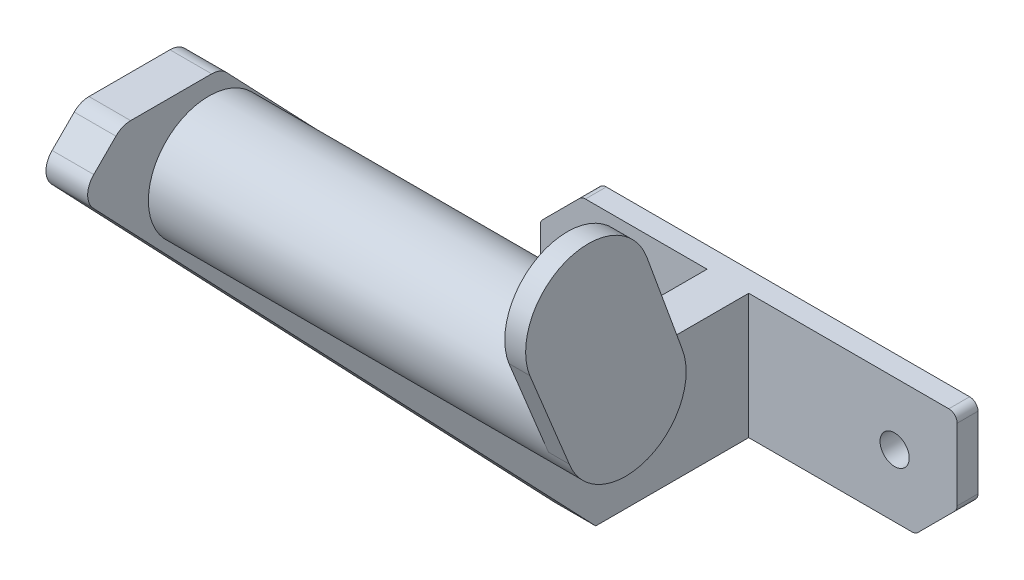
ISO-10303-21;
HEADER;
FILE_DESCRIPTION(('STEP AP214'),'2;1');
FILE_NAME('part.step','',(''),(''),'','','');
FILE_SCHEMA(('AUTOMOTIVE_DESIGN { 1 0 10303 214 1 1 1 1 }'));
ENDSEC;
DATA;
#1=APPLICATION_CONTEXT('core data for automotive mechanical design processes');
#2=APPLICATION_PROTOCOL_DEFINITION('international standard','automotive_design',2000,#1);
#3=PRODUCT_CONTEXT('',#1,'mechanical');
#4=PRODUCT('Part','Part','',(#3));
#5=PRODUCT_RELATED_PRODUCT_CATEGORY('part','',(#4));
#6=PRODUCT_DEFINITION_FORMATION('','',#4);
#7=PRODUCT_DEFINITION_CONTEXT('part definition',#1,'design');
#8=PRODUCT_DEFINITION('design','',#6,#7);
#9=PRODUCT_DEFINITION_SHAPE('','',#8);
#10=(LENGTH_UNIT() NAMED_UNIT(*) SI_UNIT(.MILLI.,.METRE.));
#11=(NAMED_UNIT(*) PLANE_ANGLE_UNIT() SI_UNIT($,.RADIAN.));
#12=(NAMED_UNIT(*) SI_UNIT($,.STERADIAN.) SOLID_ANGLE_UNIT());
#13=UNCERTAINTY_MEASURE_WITH_UNIT(LENGTH_MEASURE(1.E-05),#10,'distance_accuracy_value','');
#14=(GEOMETRIC_REPRESENTATION_CONTEXT(3) GLOBAL_UNCERTAINTY_ASSIGNED_CONTEXT((#13)) GLOBAL_UNIT_ASSIGNED_CONTEXT((#10,
#11,#12)) REPRESENTATION_CONTEXT('',''));
#15=CARTESIAN_POINT('',(0.,0.,0.));
#16=DIRECTION('',(0.,0.,1.));
#17=DIRECTION('',(1.,0.,0.));
#18=AXIS2_PLACEMENT_3D('',#15,#16,#17);
#19=CARTESIAN_POINT('',(145.,144.54626642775,143.51431580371));
#20=DIRECTION('',(1.,0.,0.));
#21=DIRECTION('',(0.,0.,-1.));
#22=AXIS2_PLACEMENT_3D('',#19,#20,#21);
#23=CYLINDRICAL_SURFACE('',#22,15.);
#24=CARTESIAN_POINT('',(145.,144.54626642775,143.51431580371));
#25=DIRECTION('',(1.,0.,0.));
#26=DIRECTION('',(0.,0.,-1.));
#27=AXIS2_PLACEMENT_3D('',#24,#25,#26);
#28=CIRCLE('',#27,15.);
#29=CARTESIAN_POINT('',(145.,149.948852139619,129.521029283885));
#30=VERTEX_POINT('',#29);
#31=CARTESIAN_POINT('',(145.,139.143680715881,157.507602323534));
#32=VERTEX_POINT('',#31);
#33=EDGE_CURVE('E292',#30,#32,#28,.T.);
#34=ORIENTED_EDGE('',*,*,#33,.T.);
#35=DIRECTION('',(1.,0.,0.));
#36=VECTOR('',#35,1.);
#37=CARTESIAN_POINT('',(145.,139.143680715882,157.507602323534));
#38=LINE('',#37,#36);
#39=CARTESIAN_POINT('',(150.,139.143680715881,157.507602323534));
#40=VERTEX_POINT('',#39);
#41=EDGE_CURVE('E301',#40,#32,#38,.F.);
#42=ORIENTED_EDGE('',*,*,#41,.F.);
#43=CARTESIAN_POINT('',(150.,144.54626642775,143.51431580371));
#44=DIRECTION('',(1.,0.,0.));
#45=DIRECTION('',(0.,0.,-1.));
#46=AXIS2_PLACEMENT_3D('',#43,#44,#45);
#47=CIRCLE('',#46,15.);
#48=CARTESIAN_POINT('',(150.,149.948852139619,129.521029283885));
#49=VERTEX_POINT('',#48);
#50=EDGE_CURVE('E302',#49,#40,#47,.T.);
#51=ORIENTED_EDGE('',*,*,#50,.F.);
#52=DIRECTION('',(1.,0.,0.));
#53=VECTOR('',#52,1.);
#54=CARTESIAN_POINT('',(145.,149.948852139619,129.521029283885));
#55=LINE('',#54,#53);
#56=EDGE_CURVE('E306',#30,#49,#55,.T.);
#57=ORIENTED_EDGE('',*,*,#56,.F.);
#58=EDGE_LOOP('',(#34,#42,#51,#57));
#59=FACE_BOUND('',#58,.T.);
#60=ADVANCED_FACE('F17',(#59),#23,.T.);
#61=CARTESIAN_POINT('',(98.,10.8284271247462,5.));
#62=DIRECTION('',(0.,0.,-1.));
#63=DIRECTION('',(-1.,0.,0.));
#64=AXIS2_PLACEMENT_3D('',#61,#62,#63);
#65=CYLINDRICAL_SURFACE('',#64,2.);
#66=CARTESIAN_POINT('',(98.,10.8284271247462,0.));
#67=DIRECTION('',(0.,0.,-1.));
#68=DIRECTION('',(-1.,0.,0.));
#69=AXIS2_PLACEMENT_3D('',#66,#67,#68);
#70=CIRCLE('',#69,2.);
#71=CARTESIAN_POINT('',(99.4142135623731,9.4142135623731,0.));
#72=VERTEX_POINT('',#71);
#73=CARTESIAN_POINT('',(100.,10.8284271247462,0.));
#74=VERTEX_POINT('',#73);
#75=EDGE_CURVE('E182',#72,#74,#70,.F.);
#76=ORIENTED_EDGE('',*,*,#75,.T.);
#77=DIRECTION('',(0.,0.,1.));
#78=VECTOR('',#77,1.);
#79=CARTESIAN_POINT('',(100.,10.8284271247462,5.));
#80=LINE('',#79,#78);
#81=CARTESIAN_POINT('',(100.,10.8284271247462,5.));
#82=VERTEX_POINT('',#81);
#83=EDGE_CURVE('E180',#74,#82,#80,.T.);
#84=ORIENTED_EDGE('',*,*,#83,.T.);
#85=CARTESIAN_POINT('',(98.,10.8284271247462,5.));
#86=DIRECTION('',(0.,0.,-1.));
#87=DIRECTION('',(-1.,0.,0.));
#88=AXIS2_PLACEMENT_3D('',#85,#86,#87);
#89=CIRCLE('',#88,2.);
#90=CARTESIAN_POINT('',(99.4142135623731,9.4142135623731,5.));
#91=VERTEX_POINT('',#90);
#92=EDGE_CURVE('E20',#82,#91,#89,.T.);
#93=ORIENTED_EDGE('',*,*,#92,.T.);
#94=DIRECTION('',(0.,0.,1.));
#95=VECTOR('',#94,1.);
#96=CARTESIAN_POINT('',(99.4142135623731,9.4142135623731,5.));
#97=LINE('',#96,#95);
#98=EDGE_CURVE('E177',#91,#72,#97,.F.);
#99=ORIENTED_EDGE('',*,*,#98,.T.);
#100=EDGE_LOOP('',(#76,#84,#93,#99));
#101=FACE_BOUND('',#100,.T.);
#102=ADVANCED_FACE('F176',(#101),#65,.T.);
#103=CARTESIAN_POINT('',(145.,149.948852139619,129.521029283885));
#104=DIRECTION('',(0.,0.34144638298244,-0.939901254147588));
#105=DIRECTION('',(0.,0.939901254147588,0.34144638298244));
#106=AXIS2_PLACEMENT_3D('',#103,#104,#105);
#107=PLANE('',#106);
#108=DIRECTION('',(0.,0.939901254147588,0.34144638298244));
#109=VECTOR('',#108,1.);
#110=CARTESIAN_POINT('',(145.,126.446621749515,120.983162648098));
#111=LINE('',#110,#109);
#112=CARTESIAN_POINT('',(145.,126.446621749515,120.983162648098));
#113=VERTEX_POINT('',#112);
#114=EDGE_CURVE('E286',#113,#30,#111,.T.);
#115=ORIENTED_EDGE('',*,*,#114,.T.);
#116=ORIENTED_EDGE('',*,*,#56,.T.);
#117=DIRECTION('',(0.,0.939901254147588,0.34144638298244));
#118=VECTOR('',#117,1.);
#119=CARTESIAN_POINT('',(150.,126.446621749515,120.983162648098));
#120=LINE('',#119,#118);
#121=CARTESIAN_POINT('',(150.,126.446621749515,120.983162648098));
#122=VERTEX_POINT('',#121);
#123=EDGE_CURVE('E303',#122,#49,#120,.T.);
#124=ORIENTED_EDGE('',*,*,#123,.F.);
#125=DIRECTION('',(-1.,0.,0.));
#126=VECTOR('',#125,1.);
#127=CARTESIAN_POINT('',(150.,126.446621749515,120.983162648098));
#128=LINE('',#127,#126);
#129=EDGE_CURVE('E189',#113,#122,#128,.F.);
#130=ORIENTED_EDGE('',*,*,#129,.F.);
#131=EDGE_LOOP('',(#115,#116,#124,#130));
#132=FACE_BOUND('',#131,.T.);
#133=ADVANCED_FACE('F762',(#132),#107,.T.);
#134=CARTESIAN_POINT('',(150.,121.224122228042,134.510006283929));
#135=DIRECTION('',(1.,0.,0.));
#136=DIRECTION('',(0.,0.,-1.));
#137=AXIS2_PLACEMENT_3D('',#134,#135,#136);
#138=PLANE('',#137);
#139=ORIENTED_EDGE('',*,*,#50,.T.);
#140=DIRECTION('',(0.,-0.925497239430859,-0.378754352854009));
#141=VECTOR('',#140,1.);
#142=CARTESIAN_POINT('',(150.,116.001622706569,148.036849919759));
#143=LINE('',#142,#141);
#144=CARTESIAN_POINT('',(150.,116.001622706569,148.036849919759));
#145=VERTEX_POINT('',#144);
#146=EDGE_CURVE('E298',#145,#40,#143,.F.);
#147=ORIENTED_EDGE('',*,*,#146,.F.);
#148=CARTESIAN_POINT('',(150.,121.224122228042,134.510006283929));
#149=DIRECTION('',(-1.,0.,0.));
#150=DIRECTION('',(0.,0.,1.));
#151=AXIS2_PLACEMENT_3D('',#148,#149,#150);
#152=CIRCLE('',#151,14.5);
#153=EDGE_CURVE('E297',#122,#145,#152,.T.);
#154=ORIENTED_EDGE('',*,*,#153,.F.);
#155=ORIENTED_EDGE('',*,*,#123,.T.);
#156=EDGE_LOOP('',(#139,#147,#154,#155));
#157=FACE_BOUND('',#156,.T.);
#158=ADVANCED_FACE('F753',(#157),#138,.T.);
#159=CARTESIAN_POINT('',(145.,116.001622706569,148.036849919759));
#160=DIRECTION('',(0.,-0.378754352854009,0.925497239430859));
#161=DIRECTION('',(0.,-0.925497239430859,-0.378754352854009));
#162=AXIS2_PLACEMENT_3D('',#159,#160,#161);
#163=PLANE('',#162);
#164=DIRECTION('',(0.,-0.925497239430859,-0.378754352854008));
#165=VECTOR('',#164,1.);
#166=CARTESIAN_POINT('',(145.,139.143680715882,157.507602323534));
#167=LINE('',#166,#165);
#168=CARTESIAN_POINT('',(145.,116.001622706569,148.036849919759));
#169=VERTEX_POINT('',#168);
#170=EDGE_CURVE('E290',#32,#169,#167,.T.);
#171=ORIENTED_EDGE('',*,*,#170,.T.);
#172=DIRECTION('',(-1.,0.,0.));
#173=VECTOR('',#172,1.);
#174=CARTESIAN_POINT('',(150.,116.001622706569,148.036849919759));
#175=LINE('',#174,#173);
#176=EDGE_CURVE('E293',#145,#169,#175,.T.);
#177=ORIENTED_EDGE('',*,*,#176,.F.);
#178=ORIENTED_EDGE('',*,*,#146,.T.);
#179=ORIENTED_EDGE('',*,*,#41,.T.);
#180=EDGE_LOOP('',(#171,#177,#178,#179));
#181=FACE_BOUND('',#180,.T.);
#182=ADVANCED_FACE('F744',(#181),#163,.T.);
#183=CARTESIAN_POINT('',(145.,144.54626642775,143.51431580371));
#184=DIRECTION('',(1.,0.,0.));
#185=DIRECTION('',(0.,0.,-1.));
#186=AXIS2_PLACEMENT_3D('',#183,#184,#185);
#187=PLANE('',#186);
#188=ORIENTED_EDGE('',*,*,#114,.F.);
#189=CARTESIAN_POINT('',(145.,121.224122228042,134.510006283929));
#190=DIRECTION('',(-1.,0.,0.));
#191=DIRECTION('',(0.,0.,1.));
#192=AXIS2_PLACEMENT_3D('',#189,#190,#191);
#193=CIRCLE('',#192,14.5);
#194=EDGE_CURVE('E296',#169,#113,#193,.T.);
#195=ORIENTED_EDGE('',*,*,#194,.F.);
#196=ORIENTED_EDGE('',*,*,#170,.F.);
#197=ORIENTED_EDGE('',*,*,#33,.F.);
#198=EDGE_LOOP('',(#188,#195,#196,#197));
#199=FACE_BOUND('',#198,.T.);
#200=ADVANCED_FACE('F736',(#199),#187,.F.);
#201=CARTESIAN_POINT('',(2.,19.1715728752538,5.));
#202=DIRECTION('',(0.,0.,-1.));
#203=DIRECTION('',(-1.,0.,0.));
#204=AXIS2_PLACEMENT_3D('',#201,#202,#203);
#205=CYLINDRICAL_SURFACE('',#204,2.);
#206=CARTESIAN_POINT('',(2.,19.1715728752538,0.));
#207=DIRECTION('',(0.,0.,-1.));
#208=DIRECTION('',(-1.,0.,0.));
#209=AXIS2_PLACEMENT_3D('',#206,#207,#208);
#210=CIRCLE('',#209,2.);
#211=CARTESIAN_POINT('',(0.585786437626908,20.5857864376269,0.));
#212=VERTEX_POINT('',#211);
#213=CARTESIAN_POINT('',(0.,19.1715728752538,0.));
#214=VERTEX_POINT('',#213);
#215=EDGE_CURVE('E283',#212,#214,#210,.F.);
#216=ORIENTED_EDGE('',*,*,#215,.T.);
#217=DIRECTION('',(0.,0.,-1.));
#218=VECTOR('',#217,1.);
#219=CARTESIAN_POINT('',(0.,19.1715728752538,5.));
#220=LINE('',#219,#218);
#221=CARTESIAN_POINT('',(0.,19.1715728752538,5.));
#222=VERTEX_POINT('',#221);
#223=EDGE_CURVE('E249',#214,#222,#220,.F.);
#224=ORIENTED_EDGE('',*,*,#223,.T.);
#225=CARTESIAN_POINT('',(2.,19.1715728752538,5.));
#226=DIRECTION('',(0.,0.,-1.));
#227=DIRECTION('',(-1.,0.,0.));
#228=AXIS2_PLACEMENT_3D('',#225,#226,#227);
#229=CIRCLE('',#228,2.);
#230=CARTESIAN_POINT('',(0.585786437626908,20.5857864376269,5.));
#231=VERTEX_POINT('',#230);
#232=EDGE_CURVE('E289',#222,#231,#229,.T.);
#233=ORIENTED_EDGE('',*,*,#232,.T.);
#234=DIRECTION('',(0.,0.,1.));
#235=VECTOR('',#234,1.);
#236=CARTESIAN_POINT('',(0.585786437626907,20.5857864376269,5.));
#237=LINE('',#236,#235);
#238=EDGE_CURVE('E245',#231,#212,#237,.F.);
#239=ORIENTED_EDGE('',*,*,#238,.T.);
#240=EDGE_LOOP('',(#216,#224,#233,#239));
#241=FACE_BOUND('',#240,.T.);
#242=ADVANCED_FACE('F499',(#241),#205,.T.);
#243=CARTESIAN_POINT('',(85.,15.,0.));
#244=DIRECTION('',(0.,0.,1.));
#245=DIRECTION('',(1.,0.,0.));
#246=AXIS2_PLACEMENT_3D('',#243,#244,#245);
#247=CYLINDRICAL_SURFACE('',#246,3.5);
#248=CARTESIAN_POINT('',(85.,15.,0.));
#249=DIRECTION('',(0.,0.,1.));
#250=DIRECTION('',(1.,0.,0.));
#251=AXIS2_PLACEMENT_3D('',#248,#249,#250);
#252=CIRCLE('',#251,3.5);
#253=CARTESIAN_POINT('',(88.5,15.,0.));
#254=VERTEX_POINT('',#253);
#255=EDGE_CURVE('E240',#254,#254,#252,.T.);
#256=ORIENTED_EDGE('',*,*,#255,.F.);
#257=EDGE_LOOP('',(#256));
#258=FACE_BOUND('',#257,.T.);
#259=CARTESIAN_POINT('',(85.,15.,5.));
#260=DIRECTION('',(0.,0.,1.));
#261=DIRECTION('',(1.,0.,0.));
#262=AXIS2_PLACEMENT_3D('',#259,#260,#261);
#263=CIRCLE('',#262,3.5);
#264=CARTESIAN_POINT('',(88.5,15.,5.));
#265=VERTEX_POINT('',#264);
#266=EDGE_CURVE('E342',#265,#265,#263,.T.);
#267=ORIENTED_EDGE('',*,*,#266,.T.);
#268=EDGE_LOOP('',(#267));
#269=FACE_BOUND('',#268,.T.);
#270=ADVANCED_FACE('F720',(#258,#269),#247,.F.);
#271=CARTESIAN_POINT('',(100.,0.,5.));
#272=DIRECTION('',(-1.,0.,0.));
#273=DIRECTION('',(0.,0.,1.));
#274=AXIS2_PLACEMENT_3D('',#271,#272,#273);
#275=PLANE('',#274);
#276=ORIENTED_EDGE('',*,*,#83,.F.);
#277=DIRECTION('',(0.,1.,0.));
#278=VECTOR('',#277,1.);
#279=CARTESIAN_POINT('',(100.,0.,0.));
#280=LINE('',#279,#278);
#281=CARTESIAN_POINT('',(100.,28.,0.));
#282=VERTEX_POINT('',#281);
#283=EDGE_CURVE('E226',#282,#74,#280,.F.);
#284=ORIENTED_EDGE('',*,*,#283,.F.);
#285=DIRECTION('',(0.,0.,-1.));
#286=VECTOR('',#285,1.);
#287=CARTESIAN_POINT('',(100.,28.,5.));
#288=LINE('',#287,#286);
#289=CARTESIAN_POINT('',(100.,28.,5.));
#290=VERTEX_POINT('',#289);
#291=EDGE_CURVE('E255',#290,#282,#288,.T.);
#292=ORIENTED_EDGE('',*,*,#291,.F.);
#293=DIRECTION('',(0.,1.,0.));
#294=VECTOR('',#293,1.);
#295=CARTESIAN_POINT('',(100.,0.,5.));
#296=LINE('',#295,#294);
#297=EDGE_CURVE('E196',#290,#82,#296,.F.);
#298=ORIENTED_EDGE('',*,*,#297,.T.);
#299=EDGE_LOOP('',(#276,#284,#292,#298));
#300=FACE_BOUND('',#299,.T.);
#301=ADVANCED_FACE('F367',(#300),#275,.F.);
#302=CARTESIAN_POINT('',(100.,10.,5.));
#303=DIRECTION('',(-0.707106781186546,0.707106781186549,0.));
#304=DIRECTION('',(-0.707106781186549,-0.707106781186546,0.));
#305=AXIS2_PLACEMENT_3D('',#302,#303,#304);
#306=PLANE('',#305);
#307=DIRECTION('',(0.,0.,1.));
#308=VECTOR('',#307,1.);
#309=CARTESIAN_POINT('',(90.5857864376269,0.585786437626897,5.));
#310=LINE('',#309,#308);
#311=CARTESIAN_POINT('',(90.5857864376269,0.5857864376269,0.));
#312=VERTEX_POINT('',#311);
#313=CARTESIAN_POINT('',(90.5857864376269,0.585786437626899,5.));
#314=VERTEX_POINT('',#313);
#315=EDGE_CURVE('E252',#312,#314,#310,.T.);
#316=ORIENTED_EDGE('',*,*,#315,.F.);
#317=DIRECTION('',(-0.707106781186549,-0.707106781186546,0.));
#318=VECTOR('',#317,1.);
#319=CARTESIAN_POINT('',(99.4142135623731,9.41421356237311,0.));
#320=LINE('',#319,#318);
#321=EDGE_CURVE('E188',#72,#312,#320,.T.);
#322=ORIENTED_EDGE('',*,*,#321,.F.);
#323=ORIENTED_EDGE('',*,*,#98,.F.);
#324=DIRECTION('',(-0.707106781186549,-0.707106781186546,0.));
#325=VECTOR('',#324,1.);
#326=CARTESIAN_POINT('',(99.4142135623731,9.4142135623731,5.));
#327=LINE('',#326,#325);
#328=EDGE_CURVE('E185',#91,#314,#327,.T.);
#329=ORIENTED_EDGE('',*,*,#328,.T.);
#330=EDGE_LOOP('',(#316,#322,#323,#329));
#331=FACE_BOUND('',#330,.T.);
#332=ADVANCED_FACE('F184',(#331),#306,.F.);
#333=CARTESIAN_POINT('',(150.,121.224122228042,134.510006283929));
#334=DIRECTION('',(-1.,0.,0.));
#335=DIRECTION('',(0.,0.,1.));
#336=AXIS2_PLACEMENT_3D('',#333,#334,#335);
#337=CYLINDRICAL_SURFACE('',#336,14.5);
#338=ORIENTED_EDGE('',*,*,#129,.T.);
#339=ORIENTED_EDGE('',*,*,#153,.T.);
#340=ORIENTED_EDGE('',*,*,#176,.T.);
#341=ORIENTED_EDGE('',*,*,#194,.T.);
#342=EDGE_LOOP('',(#338,#339,#340,#341));
#343=FACE_BOUND('',#342,.T.);
#344=CARTESIAN_POINT('',(50.,121.224122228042,134.510006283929));
#345=DIRECTION('',(-1.,0.,0.));
#346=DIRECTION('',(0.,0.,1.));
#347=AXIS2_PLACEMENT_3D('',#344,#345,#346);
#348=CIRCLE('',#347,14.5);
#349=CARTESIAN_POINT('',(50.,121.224122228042,149.010006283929));
#350=VERTEX_POINT('',#349);
#351=EDGE_CURVE('E198',#350,#350,#348,.F.);
#352=ORIENTED_EDGE('',*,*,#351,.T.);
#353=EDGE_LOOP('',(#352));
#354=FACE_BOUND('',#353,.T.);
#355=ADVANCED_FACE('F506',(#343,#354),#337,.T.);
#356=CARTESIAN_POINT('',(10.8284271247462,28.,5.));
#357=DIRECTION('',(0.,0.,1.));
#358=DIRECTION('',(1.,0.,0.));
#359=AXIS2_PLACEMENT_3D('',#356,#357,#358);
#360=CYLINDRICAL_SURFACE('',#359,2.);
#361=CARTESIAN_POINT('',(10.8284271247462,28.,5.));
#362=DIRECTION('',(0.,0.,1.));
#363=DIRECTION('',(1.,0.,0.));
#364=AXIS2_PLACEMENT_3D('',#361,#362,#363);
#365=CIRCLE('',#364,2.);
#366=CARTESIAN_POINT('',(9.41421356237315,29.4142135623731,5.));
#367=VERTEX_POINT('',#366);
#368=CARTESIAN_POINT('',(10.8284271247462,30.,5.));
#369=VERTEX_POINT('',#368);
#370=EDGE_CURVE('E285',#367,#369,#365,.F.);
#371=ORIENTED_EDGE('',*,*,#370,.T.);
#372=DIRECTION('',(0.,0.,-1.));
#373=VECTOR('',#372,1.);
#374=CARTESIAN_POINT('',(10.8284271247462,30.,5.));
#375=LINE('',#374,#373);
#376=CARTESIAN_POINT('',(10.8284271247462,30.,0.));
#377=VERTEX_POINT('',#376);
#378=EDGE_CURVE('E241',#369,#377,#375,.T.);
#379=ORIENTED_EDGE('',*,*,#378,.T.);
#380=CARTESIAN_POINT('',(10.8284271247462,28.,0.));
#381=DIRECTION('',(0.,0.,1.));
#382=DIRECTION('',(1.,0.,0.));
#383=AXIS2_PLACEMENT_3D('',#380,#381,#382);
#384=CIRCLE('',#383,2.);
#385=CARTESIAN_POINT('',(9.41421356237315,29.4142135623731,0.));
#386=VERTEX_POINT('',#385);
#387=EDGE_CURVE('E234',#386,#377,#384,.F.);
#388=ORIENTED_EDGE('',*,*,#387,.F.);
#389=DIRECTION('',(0.,0.,1.));
#390=VECTOR('',#389,1.);
#391=CARTESIAN_POINT('',(9.41421356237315,29.4142135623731,5.));
#392=LINE('',#391,#390);
#393=EDGE_CURVE('E248',#386,#367,#392,.T.);
#394=ORIENTED_EDGE('',*,*,#393,.T.);
#395=EDGE_LOOP('',(#371,#379,#388,#394));
#396=FACE_BOUND('',#395,.T.);
#397=ADVANCED_FACE('F504',(#396),#360,.T.);
#398=CARTESIAN_POINT('',(98.,28.,5.));
#399=DIRECTION('',(0.,0.,-1.));
#400=DIRECTION('',(-1.,0.,0.));
#401=AXIS2_PLACEMENT_3D('',#398,#399,#400);
#402=CYLINDRICAL_SURFACE('',#401,2.);
#403=CARTESIAN_POINT('',(98.,28.,0.));
#404=DIRECTION('',(0.,0.,-1.));
#405=DIRECTION('',(-1.,0.,0.));
#406=AXIS2_PLACEMENT_3D('',#403,#404,#405);
#407=CIRCLE('',#406,2.);
#408=CARTESIAN_POINT('',(98.,30.,0.));
#409=VERTEX_POINT('',#408);
#410=EDGE_CURVE('E230',#409,#282,#407,.T.);
#411=ORIENTED_EDGE('',*,*,#410,.F.);
#412=DIRECTION('',(0.,0.,-1.));
#413=VECTOR('',#412,1.);
#414=CARTESIAN_POINT('',(98.,30.,5.));
#415=LINE('',#414,#413);
#416=CARTESIAN_POINT('',(98.,30.,5.));
#417=VERTEX_POINT('',#416);
#418=EDGE_CURVE('E259',#409,#417,#415,.F.);
#419=ORIENTED_EDGE('',*,*,#418,.T.);
#420=CARTESIAN_POINT('',(98.,28.,5.));
#421=DIRECTION('',(0.,0.,-1.));
#422=DIRECTION('',(-1.,0.,0.));
#423=AXIS2_PLACEMENT_3D('',#420,#421,#422);
#424=CIRCLE('',#423,2.);
#425=EDGE_CURVE('E200',#417,#290,#424,.T.);
#426=ORIENTED_EDGE('',*,*,#425,.T.);
#427=ORIENTED_EDGE('',*,*,#291,.T.);
#428=EDGE_LOOP('',(#411,#419,#426,#427));
#429=FACE_BOUND('',#428,.T.);
#430=ADVANCED_FACE('F373',(#429),#402,.T.);
#431=CARTESIAN_POINT('',(15.,15.,0.));
#432=DIRECTION('',(0.,0.,1.));
#433=DIRECTION('',(1.,0.,0.));
#434=AXIS2_PLACEMENT_3D('',#431,#432,#433);
#435=CYLINDRICAL_SURFACE('',#434,3.5);
#436=CARTESIAN_POINT('',(15.,15.,0.));
#437=DIRECTION('',(0.,0.,1.));
#438=DIRECTION('',(1.,0.,0.));
#439=AXIS2_PLACEMENT_3D('',#436,#437,#438);
#440=CIRCLE('',#439,3.5);
#441=CARTESIAN_POINT('',(18.5,15.,0.));
#442=VERTEX_POINT('',#441);
#443=EDGE_CURVE('E280',#442,#442,#440,.T.);
#444=ORIENTED_EDGE('',*,*,#443,.F.);
#445=EDGE_LOOP('',(#444));
#446=FACE_BOUND('',#445,.T.);
#447=CARTESIAN_POINT('',(15.,15.,5.));
#448=DIRECTION('',(0.,0.,1.));
#449=DIRECTION('',(1.,0.,0.));
#450=AXIS2_PLACEMENT_3D('',#447,#448,#449);
#451=CIRCLE('',#450,3.5);
#452=CARTESIAN_POINT('',(18.5,15.,5.));
#453=VERTEX_POINT('',#452);
#454=EDGE_CURVE('E269',#453,#453,#451,.T.);
#455=ORIENTED_EDGE('',*,*,#454,.T.);
#456=EDGE_LOOP('',(#455));
#457=FACE_BOUND('',#456,.T.);
#458=ADVANCED_FACE('F513',(#446,#457),#435,.F.);
#459=CARTESIAN_POINT('',(0.,0.,5.));
#460=DIRECTION('',(1.,0.,0.));
#461=DIRECTION('',(0.,0.,-1.));
#462=AXIS2_PLACEMENT_3D('',#459,#460,#461);
#463=PLANE('',#462);
#464=ORIENTED_EDGE('',*,*,#223,.F.);
#465=DIRECTION('',(0.,1.,0.));
#466=VECTOR('',#465,1.);
#467=CARTESIAN_POINT('',(0.,0.,0.));
#468=LINE('',#467,#466);
#469=CARTESIAN_POINT('',(0.,2.,0.));
#470=VERTEX_POINT('',#469);
#471=EDGE_CURVE('E235',#470,#214,#468,.T.);
#472=ORIENTED_EDGE('',*,*,#471,.F.);
#473=DIRECTION('',(0.,0.,-1.));
#474=VECTOR('',#473,1.);
#475=CARTESIAN_POINT('',(0.,2.,5.));
#476=LINE('',#475,#474);
#477=CARTESIAN_POINT('',(0.,2.,5.));
#478=VERTEX_POINT('',#477);
#479=EDGE_CURVE('E229',#478,#470,#476,.T.);
#480=ORIENTED_EDGE('',*,*,#479,.F.);
#481=DIRECTION('',(0.,1.,0.));
#482=VECTOR('',#481,1.);
#483=CARTESIAN_POINT('',(0.,0.,5.));
#484=LINE('',#483,#482);
#485=EDGE_CURVE('E332',#478,#222,#484,.T.);
#486=ORIENTED_EDGE('',*,*,#485,.T.);
#487=EDGE_LOOP('',(#464,#472,#480,#486));
#488=FACE_BOUND('',#487,.T.);
#489=ADVANCED_FACE('F495',(#488),#463,.F.);
#490=CARTESIAN_POINT('',(0.,20.,5.));
#491=DIRECTION('',(0.707106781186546,-0.707106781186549,0.));
#492=DIRECTION('',(0.707106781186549,0.707106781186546,0.));
#493=AXIS2_PLACEMENT_3D('',#490,#491,#492);
#494=PLANE('',#493);
#495=ORIENTED_EDGE('',*,*,#393,.F.);
#496=DIRECTION('',(0.707106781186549,0.707106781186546,0.));
#497=VECTOR('',#496,1.);
#498=CARTESIAN_POINT('',(0.585786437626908,20.5857864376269,0.));
#499=LINE('',#498,#497);
#500=EDGE_CURVE('E231',#212,#386,#499,.T.);
#501=ORIENTED_EDGE('',*,*,#500,.F.);
#502=ORIENTED_EDGE('',*,*,#238,.F.);
#503=DIRECTION('',(0.707106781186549,0.707106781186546,0.));
#504=VECTOR('',#503,1.);
#505=CARTESIAN_POINT('',(0.585786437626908,20.5857864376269,5.));
#506=LINE('',#505,#504);
#507=EDGE_CURVE('E452',#231,#367,#506,.T.);
#508=ORIENTED_EDGE('',*,*,#507,.T.);
#509=EDGE_LOOP('',(#495,#501,#502,#508));
#510=FACE_BOUND('',#509,.T.);
#511=ADVANCED_FACE('F501',(#510),#494,.F.);
#512=CARTESIAN_POINT('',(89.1715728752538,2.,5.));
#513=DIRECTION('',(0.,0.,1.));
#514=DIRECTION('',(1.,0.,0.));
#515=AXIS2_PLACEMENT_3D('',#512,#513,#514);
#516=CYLINDRICAL_SURFACE('',#515,2.);
#517=CARTESIAN_POINT('',(89.1715728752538,2.,5.));
#518=DIRECTION('',(0.,0.,1.));
#519=DIRECTION('',(1.,0.,0.));
#520=AXIS2_PLACEMENT_3D('',#517,#518,#519);
#521=CIRCLE('',#520,2.);
#522=CARTESIAN_POINT('',(89.1715728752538,0.,5.));
#523=VERTEX_POINT('',#522);
#524=EDGE_CURVE('E195',#314,#523,#521,.F.);
#525=ORIENTED_EDGE('',*,*,#524,.T.);
#526=DIRECTION('',(0.,0.,1.));
#527=VECTOR('',#526,1.);
#528=CARTESIAN_POINT('',(89.1715728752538,0.,5.));
#529=LINE('',#528,#527);
#530=CARTESIAN_POINT('',(89.1715728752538,0.,0.));
#531=VERTEX_POINT('',#530);
#532=EDGE_CURVE('E206',#523,#531,#529,.F.);
#533=ORIENTED_EDGE('',*,*,#532,.T.);
#534=CARTESIAN_POINT('',(89.1715728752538,2.,0.));
#535=DIRECTION('',(0.,0.,1.));
#536=DIRECTION('',(1.,0.,0.));
#537=AXIS2_PLACEMENT_3D('',#534,#535,#536);
#538=CIRCLE('',#537,2.);
#539=EDGE_CURVE('E238',#312,#531,#538,.F.);
#540=ORIENTED_EDGE('',*,*,#539,.F.);
#541=ORIENTED_EDGE('',*,*,#315,.T.);
#542=EDGE_LOOP('',(#525,#533,#540,#541));
#543=FACE_BOUND('',#542,.T.);
#544=ADVANCED_FACE('F481',(#543),#516,.T.);
#545=CARTESIAN_POINT('',(0.,0.,0.));
#546=DIRECTION('',(0.,0.,-1.));
#547=DIRECTION('',(-1.,0.,0.));
#548=AXIS2_PLACEMENT_3D('',#545,#546,#547);
#549=PLANE('',#548);
#550=ORIENTED_EDGE('',*,*,#283,.T.);
#551=ORIENTED_EDGE('',*,*,#75,.F.);
#552=ORIENTED_EDGE('',*,*,#321,.T.);
#553=ORIENTED_EDGE('',*,*,#539,.T.);
#554=DIRECTION('',(1.,0.,0.));
#555=VECTOR('',#554,1.);
#556=CARTESIAN_POINT('',(0.,0.,0.));
#557=LINE('',#556,#555);
#558=CARTESIAN_POINT('',(2.,0.,0.));
#559=VERTEX_POINT('',#558);
#560=EDGE_CURVE('E208',#531,#559,#557,.F.);
#561=ORIENTED_EDGE('',*,*,#560,.T.);
#562=CARTESIAN_POINT('',(2.,2.,0.));
#563=DIRECTION('',(0.,0.,-1.));
#564=DIRECTION('',(-1.,0.,0.));
#565=AXIS2_PLACEMENT_3D('',#562,#563,#564);
#566=CIRCLE('',#565,2.);
#567=EDGE_CURVE('E258',#470,#559,#566,.F.);
#568=ORIENTED_EDGE('',*,*,#567,.F.);
#569=ORIENTED_EDGE('',*,*,#471,.T.);
#570=ORIENTED_EDGE('',*,*,#215,.F.);
#571=ORIENTED_EDGE('',*,*,#500,.T.);
#572=ORIENTED_EDGE('',*,*,#387,.T.);
#573=DIRECTION('',(1.,0.,0.));
#574=VECTOR('',#573,1.);
#575=CARTESIAN_POINT('',(0.,30.,0.));
#576=LINE('',#575,#574);
#577=EDGE_CURVE('E243',#377,#409,#576,.T.);
#578=ORIENTED_EDGE('',*,*,#577,.T.);
#579=ORIENTED_EDGE('',*,*,#410,.T.);
#580=EDGE_LOOP('',(#550,#551,#552,#553,#561,#568,#569,#570,#571,#572,#578,#579));
#581=FACE_BOUND('',#580,.T.);
#582=ORIENTED_EDGE('',*,*,#255,.T.);
#583=EDGE_LOOP('',(#582));
#584=FACE_BOUND('',#583,.T.);
#585=ORIENTED_EDGE('',*,*,#443,.T.);
#586=EDGE_LOOP('',(#585));
#587=FACE_BOUND('',#586,.T.);
#588=ADVANCED_FACE('F368',(#581,#584,#587),#549,.T.);
#589=CARTESIAN_POINT('',(2.,2.,5.));
#590=DIRECTION('',(0.,0.,-1.));
#591=DIRECTION('',(-1.,0.,0.));
#592=AXIS2_PLACEMENT_3D('',#589,#590,#591);
#593=CYLINDRICAL_SURFACE('',#592,2.);
#594=ORIENTED_EDGE('',*,*,#567,.T.);
#595=DIRECTION('',(0.,0.,1.));
#596=VECTOR('',#595,1.);
#597=CARTESIAN_POINT('',(2.,0.,5.));
#598=LINE('',#597,#596);
#599=CARTESIAN_POINT('',(2.,0.,5.));
#600=VERTEX_POINT('',#599);
#601=EDGE_CURVE('E222',#559,#600,#598,.T.);
#602=ORIENTED_EDGE('',*,*,#601,.T.);
#603=CARTESIAN_POINT('',(2.,2.,5.));
#604=DIRECTION('',(0.,0.,-1.));
#605=DIRECTION('',(-1.,0.,0.));
#606=AXIS2_PLACEMENT_3D('',#603,#604,#605);
#607=CIRCLE('',#606,2.);
#608=EDGE_CURVE('E329',#600,#478,#607,.T.);
#609=ORIENTED_EDGE('',*,*,#608,.T.);
#610=ORIENTED_EDGE('',*,*,#479,.T.);
#611=EDGE_LOOP('',(#594,#602,#609,#610));
#612=FACE_BOUND('',#611,.T.);
#613=ADVANCED_FACE('F484',(#612),#593,.T.);
#614=CARTESIAN_POINT('',(0.,0.,5.));
#615=DIRECTION('',(0.,0.,-1.));
#616=DIRECTION('',(-1.,0.,0.));
#617=AXIS2_PLACEMENT_3D('',#614,#615,#616);
#618=PLANE('',#617);
#619=DIRECTION('',(1.,0.,0.));
#620=VECTOR('',#619,1.);
#621=CARTESIAN_POINT('',(0.,0.,5.));
#622=LINE('',#621,#620);
#623=CARTESIAN_POINT('',(50.,0.,5.));
#624=VERTEX_POINT('',#623);
#625=EDGE_CURVE('E210',#624,#523,#622,.T.);
#626=ORIENTED_EDGE('',*,*,#625,.T.);
#627=ORIENTED_EDGE('',*,*,#524,.F.);
#628=ORIENTED_EDGE('',*,*,#328,.F.);
#629=ORIENTED_EDGE('',*,*,#92,.F.);
#630=ORIENTED_EDGE('',*,*,#297,.F.);
#631=ORIENTED_EDGE('',*,*,#425,.F.);
#632=DIRECTION('',(1.,0.,0.));
#633=VECTOR('',#632,1.);
#634=CARTESIAN_POINT('',(0.,30.,5.));
#635=LINE('',#634,#633);
#636=CARTESIAN_POINT('',(50.,30.,5.));
#637=VERTEX_POINT('',#636);
#638=EDGE_CURVE('E261',#417,#637,#635,.F.);
#639=ORIENTED_EDGE('',*,*,#638,.T.);
#640=DIRECTION('',(0.,1.,0.));
#641=VECTOR('',#640,1.);
#642=CARTESIAN_POINT('',(50.,0.,5.));
#643=LINE('',#642,#641);
#644=EDGE_CURVE('E216',#637,#624,#643,.F.);
#645=ORIENTED_EDGE('',*,*,#644,.T.);
#646=EDGE_LOOP('',(#626,#627,#628,#629,#630,#631,#639,#645));
#647=FACE_BOUND('',#646,.T.);
#648=ORIENTED_EDGE('',*,*,#266,.F.);
#649=EDGE_LOOP('',(#648));
#650=FACE_BOUND('',#649,.T.);
#651=ADVANCED_FACE('F193',(#647,#650),#618,.F.);
#652=CARTESIAN_POINT('',(50.,0.,0.));
#653=DIRECTION('',(-1.,0.,0.));
#654=DIRECTION('',(0.,0.,1.));
#655=AXIS2_PLACEMENT_3D('',#652,#653,#654);
#656=PLANE('',#655);
#657=CARTESIAN_POINT('',(50.,135.,133.835247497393));
#658=DIRECTION('',(-1.,0.,0.));
#659=DIRECTION('',(0.,0.,1.));
#660=AXIS2_PLACEMENT_3D('',#657,#658,#659);
#661=CIRCLE('',#660,5.);
#662=CARTESIAN_POINT('',(50.,140.,133.835247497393));
#663=VERTEX_POINT('',#662);
#664=CARTESIAN_POINT('',(50.,138.452378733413,130.218469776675));
#665=VERTEX_POINT('',#664);
#666=EDGE_CURVE('E335',#663,#665,#661,.T.);
#667=ORIENTED_EDGE('',*,*,#666,.F.);
#668=DIRECTION('',(0.,0.,1.));
#669=VECTOR('',#668,1.);
#670=CARTESIAN_POINT('',(50.,140.,175.332108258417));
#671=LINE('',#670,#669);
#672=CARTESIAN_POINT('',(50.,140.,153.261040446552));
#673=VERTEX_POINT('',#672);
#674=EDGE_CURVE('E219',#673,#663,#671,.F.);
#675=ORIENTED_EDGE('',*,*,#674,.F.);
#676=CARTESIAN_POINT('',(50.,135.,153.261040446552));
#677=DIRECTION('',(-1.,0.,0.));
#678=DIRECTION('',(0.,0.,1.));
#679=AXIS2_PLACEMENT_3D('',#676,#677,#678);
#680=CIRCLE('',#679,5.);
#681=CARTESIAN_POINT('',(50.,138.535533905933,156.796574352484));
#682=VERTEX_POINT('',#681);
#683=EDGE_CURVE('E321',#682,#673,#680,.T.);
#684=ORIENTED_EDGE('',*,*,#683,.F.);
#685=DIRECTION('',(0.,0.707106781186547,-0.707106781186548));
#686=VECTOR('',#685,1.);
#687=CARTESIAN_POINT('',(50.,129.767441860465,165.564666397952));
#688=LINE('',#687,#686);
#689=CARTESIAN_POINT('',(50.,133.221709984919,162.110398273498));
#690=VERTEX_POINT('',#689);
#691=EDGE_CURVE('E431',#682,#690,#688,.F.);
#692=ORIENTED_EDGE('',*,*,#691,.T.);
#693=CARTESIAN_POINT('',(50.,129.686176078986,158.574864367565));
#694=DIRECTION('',(1.,0.,0.));
#695=DIRECTION('',(0.,0.,-1.));
#696=AXIS2_PLACEMENT_3D('',#693,#694,#695);
#697=CIRCLE('',#696,5.);
#698=CARTESIAN_POINT('',(50.,126.233797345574,162.191642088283));
#699=VERTEX_POINT('',#698);
#700=EDGE_CURVE('E325',#699,#690,#697,.F.);
#701=ORIENTED_EDGE('',*,*,#700,.F.);
#702=DIRECTION('',(0.,-0.723355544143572,-0.690475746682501));
#703=VECTOR('',#702,1.);
#704=CARTESIAN_POINT('',(50.,0.,41.6957446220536));
#705=LINE('',#704,#703);
#706=CARTESIAN_POINT('',(50.,0.,41.6957446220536));
#707=VERTEX_POINT('',#706);
#708=EDGE_CURVE('E212',#707,#699,#705,.F.);
#709=ORIENTED_EDGE('',*,*,#708,.F.);
#710=DIRECTION('',(0.,0.,1.));
#711=VECTOR('',#710,1.);
#712=CARTESIAN_POINT('',(50.,0.,5.));
#713=LINE('',#712,#711);
#714=EDGE_CURVE('E213',#707,#624,#713,.F.);
#715=ORIENTED_EDGE('',*,*,#714,.T.);
#716=ORIENTED_EDGE('',*,*,#644,.F.);
#717=DIRECTION('',(0.,0.,-1.));
#718=VECTOR('',#717,1.);
#719=CARTESIAN_POINT('',(50.,30.,5.));
#720=LINE('',#719,#718);
#721=CARTESIAN_POINT('',(50.,30.,26.6957446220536));
#722=VERTEX_POINT('',#721);
#723=EDGE_CURVE('E264',#637,#722,#720,.F.);
#724=ORIENTED_EDGE('',*,*,#723,.T.);
#725=DIRECTION('',(0.,0.723355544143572,0.690475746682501));
#726=VECTOR('',#725,1.);
#727=CARTESIAN_POINT('',(50.,140.,131.695744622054));
#728=LINE('',#727,#726);
#729=EDGE_CURVE('E274',#665,#722,#728,.F.);
#730=ORIENTED_EDGE('',*,*,#729,.F.);
#731=EDGE_LOOP('',(#667,#675,#684,#692,#701,#709,#715,#716,#724,#730));
#732=FACE_BOUND('',#731,.T.);
#733=ORIENTED_EDGE('',*,*,#351,.F.);
#734=EDGE_LOOP('',(#733));
#735=FACE_BOUND('',#734,.T.);
#736=ADVANCED_FACE('F385',(#732,#735),#656,.F.);
#737=CARTESIAN_POINT('',(50.,140.,175.332108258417));
#738=DIRECTION('',(0.,1.,0.));
#739=DIRECTION('',(0.,0.,1.));
#740=AXIS2_PLACEMENT_3D('',#737,#738,#739);
#741=PLANE('',#740);
#742=DIRECTION('',(0.,0.,1.));
#743=VECTOR('',#742,1.);
#744=CARTESIAN_POINT('',(40.,140.,0.));
#745=LINE('',#744,#743);
#746=CARTESIAN_POINT('',(40.,140.,153.261040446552));
#747=VERTEX_POINT('',#746);
#748=CARTESIAN_POINT('',(40.,140.,133.835247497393));
#749=VERTEX_POINT('',#748);
#750=EDGE_CURVE('E320',#747,#749,#745,.F.);
#751=ORIENTED_EDGE('',*,*,#750,.F.);
#752=DIRECTION('',(-1.,0.,0.));
#753=VECTOR('',#752,1.);
#754=CARTESIAN_POINT('',(50.,140.,153.261040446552));
#755=LINE('',#754,#753);
#756=EDGE_CURVE('E324',#673,#747,#755,.T.);
#757=ORIENTED_EDGE('',*,*,#756,.F.);
#758=ORIENTED_EDGE('',*,*,#674,.T.);
#759=DIRECTION('',(-1.,0.,0.));
#760=VECTOR('',#759,1.);
#761=CARTESIAN_POINT('',(50.,140.,133.835247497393));
#762=LINE('',#761,#760);
#763=EDGE_CURVE('E337',#749,#663,#762,.F.);
#764=ORIENTED_EDGE('',*,*,#763,.F.);
#765=EDGE_LOOP('',(#751,#757,#758,#764));
#766=FACE_BOUND('',#765,.T.);
#767=ADVANCED_FACE('F548',(#766),#741,.T.);
#768=CARTESIAN_POINT('',(50.,135.,133.835247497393));
#769=DIRECTION('',(-1.,0.,0.));
#770=DIRECTION('',(0.,0.,1.));
#771=AXIS2_PLACEMENT_3D('',#768,#769,#770);
#772=CYLINDRICAL_SURFACE('',#771,5.);
#773=CARTESIAN_POINT('',(40.,135.,133.835247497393));
#774=DIRECTION('',(-1.,0.,0.));
#775=DIRECTION('',(0.,0.,1.));
#776=AXIS2_PLACEMENT_3D('',#773,#774,#775);
#777=CIRCLE('',#776,5.);
#778=CARTESIAN_POINT('',(40.,138.452378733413,130.218469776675));
#779=VERTEX_POINT('',#778);
#780=EDGE_CURVE('E316',#749,#779,#777,.T.);
#781=ORIENTED_EDGE('',*,*,#780,.F.);
#782=ORIENTED_EDGE('',*,*,#763,.T.);
#783=ORIENTED_EDGE('',*,*,#666,.T.);
#784=DIRECTION('',(1.,0.,0.));
#785=VECTOR('',#784,1.);
#786=CARTESIAN_POINT('',(50.,138.452378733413,130.218469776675));
#787=LINE('',#786,#785);
#788=EDGE_CURVE('E277',#779,#665,#787,.T.);
#789=ORIENTED_EDGE('',*,*,#788,.F.);
#790=EDGE_LOOP('',(#781,#782,#783,#789));
#791=FACE_BOUND('',#790,.T.);
#792=ADVANCED_FACE('F545',(#791),#772,.T.);
#793=CARTESIAN_POINT('',(50.,140.,131.695744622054));
#794=DIRECTION('',(0.,0.690475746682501,-0.723355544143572));
#795=DIRECTION('',(0.,0.723355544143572,0.690475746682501));
#796=AXIS2_PLACEMENT_3D('',#793,#794,#795);
#797=PLANE('',#796);
#798=ORIENTED_EDGE('',*,*,#729,.T.);
#799=DIRECTION('',(1.,0.,0.));
#800=VECTOR('',#799,1.);
#801=CARTESIAN_POINT('',(0.,30.,26.6957446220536));
#802=LINE('',#801,#800);
#803=CARTESIAN_POINT('',(40.,30.,26.6957446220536));
#804=VERTEX_POINT('',#803);
#805=EDGE_CURVE('E244',#722,#804,#802,.F.);
#806=ORIENTED_EDGE('',*,*,#805,.T.);
#807=DIRECTION('',(0.,-0.723355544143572,-0.690475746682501));
#808=VECTOR('',#807,1.);
#809=CARTESIAN_POINT('',(40.,138.452378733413,130.218469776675));
#810=LINE('',#809,#808);
#811=EDGE_CURVE('E319',#779,#804,#810,.T.);
#812=ORIENTED_EDGE('',*,*,#811,.F.);
#813=ORIENTED_EDGE('',*,*,#788,.T.);
#814=EDGE_LOOP('',(#798,#806,#812,#813));
#815=FACE_BOUND('',#814,.T.);
#816=ADVANCED_FACE('F407',(#815),#797,.T.);
#817=CARTESIAN_POINT('',(0.,30.,5.));
#818=DIRECTION('',(0.,-1.,0.));
#819=DIRECTION('',(0.,0.,-1.));
#820=AXIS2_PLACEMENT_3D('',#817,#818,#819);
#821=PLANE('',#820);
#822=ORIENTED_EDGE('',*,*,#638,.F.);
#823=ORIENTED_EDGE('',*,*,#418,.F.);
#824=ORIENTED_EDGE('',*,*,#577,.F.);
#825=ORIENTED_EDGE('',*,*,#378,.F.);
#826=DIRECTION('',(-1.,0.,0.));
#827=VECTOR('',#826,1.);
#828=CARTESIAN_POINT('',(0.,30.,5.));
#829=LINE('',#828,#827);
#830=CARTESIAN_POINT('',(40.,30.,5.));
#831=VERTEX_POINT('',#830);
#832=EDGE_CURVE('E209',#369,#831,#829,.F.);
#833=ORIENTED_EDGE('',*,*,#832,.T.);
#834=DIRECTION('',(0.,0.,1.));
#835=VECTOR('',#834,1.);
#836=CARTESIAN_POINT('',(40.,30.,0.));
#837=LINE('',#836,#835);
#838=EDGE_CURVE('E411',#804,#831,#837,.F.);
#839=ORIENTED_EDGE('',*,*,#838,.F.);
#840=ORIENTED_EDGE('',*,*,#805,.F.);
#841=ORIENTED_EDGE('',*,*,#723,.F.);
#842=EDGE_LOOP('',(#822,#823,#824,#825,#833,#839,#840,#841));
#843=FACE_BOUND('',#842,.T.);
#844=ADVANCED_FACE('F379',(#843),#821,.F.);
#845=CARTESIAN_POINT('',(0.,0.,5.));
#846=DIRECTION('',(0.,0.,-1.));
#847=DIRECTION('',(-1.,0.,0.));
#848=AXIS2_PLACEMENT_3D('',#845,#846,#847);
#849=PLANE('',#848);
#850=DIRECTION('',(0.,1.,0.));
#851=VECTOR('',#850,1.);
#852=CARTESIAN_POINT('',(40.,0.,5.));
#853=LINE('',#852,#851);
#854=CARTESIAN_POINT('',(40.,0.,5.));
#855=VERTEX_POINT('',#854);
#856=EDGE_CURVE('E414',#831,#855,#853,.F.);
#857=ORIENTED_EDGE('',*,*,#856,.F.);
#858=ORIENTED_EDGE('',*,*,#832,.F.);
#859=ORIENTED_EDGE('',*,*,#370,.F.);
#860=ORIENTED_EDGE('',*,*,#507,.F.);
#861=ORIENTED_EDGE('',*,*,#232,.F.);
#862=ORIENTED_EDGE('',*,*,#485,.F.);
#863=ORIENTED_EDGE('',*,*,#608,.F.);
#864=DIRECTION('',(1.,0.,0.));
#865=VECTOR('',#864,1.);
#866=CARTESIAN_POINT('',(0.,0.,5.));
#867=LINE('',#866,#865);
#868=EDGE_CURVE('E224',#600,#855,#867,.T.);
#869=ORIENTED_EDGE('',*,*,#868,.T.);
#870=EDGE_LOOP('',(#857,#858,#859,#860,#861,#862,#863,#869));
#871=FACE_BOUND('',#870,.T.);
#872=ORIENTED_EDGE('',*,*,#454,.F.);
#873=EDGE_LOOP('',(#872));
#874=FACE_BOUND('',#873,.T.);
#875=ADVANCED_FACE('F489',(#871,#874),#849,.F.);
#876=CARTESIAN_POINT('',(0.,0.,5.));
#877=DIRECTION('',(0.,1.,0.));
#878=DIRECTION('',(0.,0.,1.));
#879=AXIS2_PLACEMENT_3D('',#876,#877,#878);
#880=PLANE('',#879);
#881=ORIENTED_EDGE('',*,*,#714,.F.);
#882=DIRECTION('',(1.,0.,0.));
#883=VECTOR('',#882,1.);
#884=CARTESIAN_POINT('',(50.,0.,41.6957446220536));
#885=LINE('',#884,#883);
#886=CARTESIAN_POINT('',(40.,0.,41.6957446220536));
#887=VERTEX_POINT('',#886);
#888=EDGE_CURVE('E328',#887,#707,#885,.T.);
#889=ORIENTED_EDGE('',*,*,#888,.F.);
#890=DIRECTION('',(0.,0.,1.));
#891=VECTOR('',#890,1.);
#892=CARTESIAN_POINT('',(40.,0.,0.));
#893=LINE('',#892,#891);
#894=EDGE_CURVE('E440',#855,#887,#893,.T.);
#895=ORIENTED_EDGE('',*,*,#894,.F.);
#896=ORIENTED_EDGE('',*,*,#868,.F.);
#897=ORIENTED_EDGE('',*,*,#601,.F.);
#898=ORIENTED_EDGE('',*,*,#560,.F.);
#899=ORIENTED_EDGE('',*,*,#532,.F.);
#900=ORIENTED_EDGE('',*,*,#625,.F.);
#901=EDGE_LOOP('',(#881,#889,#895,#896,#897,#898,#899,#900));
#902=FACE_BOUND('',#901,.T.);
#903=ADVANCED_FACE('F476',(#902),#880,.F.);
#904=CARTESIAN_POINT('',(50.,0.,41.6957446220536));
#905=DIRECTION('',(0.,-0.690475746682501,0.723355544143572));
#906=DIRECTION('',(0.,-0.723355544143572,-0.690475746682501));
#907=AXIS2_PLACEMENT_3D('',#904,#905,#906);
#908=PLANE('',#907);
#909=DIRECTION('',(0.,0.723355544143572,0.6904757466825));
#910=VECTOR('',#909,1.);
#911=CARTESIAN_POINT('',(40.,0.,41.6957446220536));
#912=LINE('',#911,#910);
#913=CARTESIAN_POINT('',(40.,126.233797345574,162.191642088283));
#914=VERTEX_POINT('',#913);
#915=EDGE_CURVE('E315',#887,#914,#912,.T.);
#916=ORIENTED_EDGE('',*,*,#915,.F.);
#917=ORIENTED_EDGE('',*,*,#888,.T.);
#918=ORIENTED_EDGE('',*,*,#708,.T.);
#919=DIRECTION('',(1.,0.,0.));
#920=VECTOR('',#919,1.);
#921=CARTESIAN_POINT('',(50.,126.233797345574,162.191642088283));
#922=LINE('',#921,#920);
#923=EDGE_CURVE('E327',#914,#699,#922,.T.);
#924=ORIENTED_EDGE('',*,*,#923,.F.);
#925=EDGE_LOOP('',(#916,#917,#918,#924));
#926=FACE_BOUND('',#925,.T.);
#927=ADVANCED_FACE('F532',(#926),#908,.T.);
#928=CARTESIAN_POINT('',(50.,129.686176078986,158.574864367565));
#929=DIRECTION('',(1.,0.,0.));
#930=DIRECTION('',(0.,0.,-1.));
#931=AXIS2_PLACEMENT_3D('',#928,#929,#930);
#932=CYLINDRICAL_SURFACE('',#931,5.);
#933=CARTESIAN_POINT('',(40.,129.686176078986,158.574864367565));
#934=DIRECTION('',(1.,0.,0.));
#935=DIRECTION('',(0.,0.,-1.));
#936=AXIS2_PLACEMENT_3D('',#933,#934,#935);
#937=CIRCLE('',#936,5.);
#938=CARTESIAN_POINT('',(40.,133.221709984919,162.110398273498));
#939=VERTEX_POINT('',#938);
#940=EDGE_CURVE('E312',#914,#939,#937,.F.);
#941=ORIENTED_EDGE('',*,*,#940,.F.);
#942=ORIENTED_EDGE('',*,*,#923,.T.);
#943=ORIENTED_EDGE('',*,*,#700,.T.);
#944=DIRECTION('',(1.,0.,0.));
#945=VECTOR('',#944,1.);
#946=CARTESIAN_POINT('',(50.,133.221709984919,162.110398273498));
#947=LINE('',#946,#945);
#948=EDGE_CURVE('E432',#690,#939,#947,.F.);
#949=ORIENTED_EDGE('',*,*,#948,.T.);
#950=EDGE_LOOP('',(#941,#942,#943,#949));
#951=FACE_BOUND('',#950,.T.);
#952=ADVANCED_FACE('F529',(#951),#932,.T.);
#953=CARTESIAN_POINT('',(50.,129.767441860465,165.564666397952));
#954=DIRECTION('',(0.,-0.707106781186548,-0.707106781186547));
#955=DIRECTION('',(0.,0.707106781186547,-0.707106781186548));
#956=AXIS2_PLACEMENT_3D('',#953,#954,#955);
#957=PLANE('',#956);
#958=DIRECTION('',(-1.,0.,0.));
#959=VECTOR('',#958,1.);
#960=CARTESIAN_POINT('',(50.,138.535533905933,156.796574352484));
#961=LINE('',#960,#959);
#962=CARTESIAN_POINT('',(40.,138.535533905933,156.796574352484));
#963=VERTEX_POINT('',#962);
#964=EDGE_CURVE('E35',#963,#682,#961,.F.);
#965=ORIENTED_EDGE('',*,*,#964,.F.);
#966=DIRECTION('',(0.,0.707106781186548,-0.707106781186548));
#967=VECTOR('',#966,1.);
#968=CARTESIAN_POINT('',(40.,133.221709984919,162.110398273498));
#969=LINE('',#968,#967);
#970=EDGE_CURVE('E26',#939,#963,#969,.T.);
#971=ORIENTED_EDGE('',*,*,#970,.F.);
#972=ORIENTED_EDGE('',*,*,#948,.F.);
#973=ORIENTED_EDGE('',*,*,#691,.F.);
#974=EDGE_LOOP('',(#965,#971,#972,#973));
#975=FACE_BOUND('',#974,.T.);
#976=ADVANCED_FACE('F523',(#975),#957,.F.);
#977=CARTESIAN_POINT('',(50.,135.,153.261040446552));
#978=DIRECTION('',(-1.,0.,0.));
#979=DIRECTION('',(0.,0.,1.));
#980=AXIS2_PLACEMENT_3D('',#977,#978,#979);
#981=CYLINDRICAL_SURFACE('',#980,5.);
#982=ORIENTED_EDGE('',*,*,#683,.T.);
#983=ORIENTED_EDGE('',*,*,#756,.T.);
#984=CARTESIAN_POINT('',(40.,135.,153.261040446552));
#985=DIRECTION('',(-1.,0.,0.));
#986=DIRECTION('',(0.,0.,1.));
#987=AXIS2_PLACEMENT_3D('',#984,#985,#986);
#988=CIRCLE('',#987,5.);
#989=EDGE_CURVE('E11',#963,#747,#988,.T.);
#990=ORIENTED_EDGE('',*,*,#989,.F.);
#991=ORIENTED_EDGE('',*,*,#964,.T.);
#992=EDGE_LOOP('',(#982,#983,#990,#991));
#993=FACE_BOUND('',#992,.T.);
#994=ADVANCED_FACE('F518',(#993),#981,.T.);
#995=CARTESIAN_POINT('',(40.,0.,0.));
#996=DIRECTION('',(-1.,0.,0.));
#997=DIRECTION('',(0.,0.,1.));
#998=AXIS2_PLACEMENT_3D('',#995,#996,#997);
#999=PLANE('',#998);
#1000=ORIENTED_EDGE('',*,*,#970,.T.);
#1001=ORIENTED_EDGE('',*,*,#989,.T.);
#1002=ORIENTED_EDGE('',*,*,#750,.T.);
#1003=ORIENTED_EDGE('',*,*,#780,.T.);
#1004=ORIENTED_EDGE('',*,*,#811,.T.);
#1005=ORIENTED_EDGE('',*,*,#838,.T.);
#1006=ORIENTED_EDGE('',*,*,#856,.T.);
#1007=ORIENTED_EDGE('',*,*,#894,.T.);
#1008=ORIENTED_EDGE('',*,*,#915,.T.);
#1009=ORIENTED_EDGE('',*,*,#940,.T.);
#1010=EDGE_LOOP('',(#1000,#1001,#1002,#1003,#1004,#1005,#1006,#1007,#1008,#1009));
#1011=FACE_BOUND('',#1010,.T.);
#1012=ADVANCED_FACE('F417',(#1011),#999,.T.);
#1013=CLOSED_SHELL('',(#60,#102,#133,#158,#182,#200,#242,#270,#301,#332,#355,#397,#430,#458,
#489,#511,#544,#588,#613,#651,#736,#767,#792,#816,#844,#875,#903,#927,#952,#976,#994,#1012));
#1014=MANIFOLD_SOLID_BREP('B1',#1013);
#1015=ADVANCED_BREP_SHAPE_REPRESENTATION('',(#18,#1014),#14);
#1016=SHAPE_DEFINITION_REPRESENTATION(#9,#1015);
ENDSEC;
END-ISO-10303-21;
